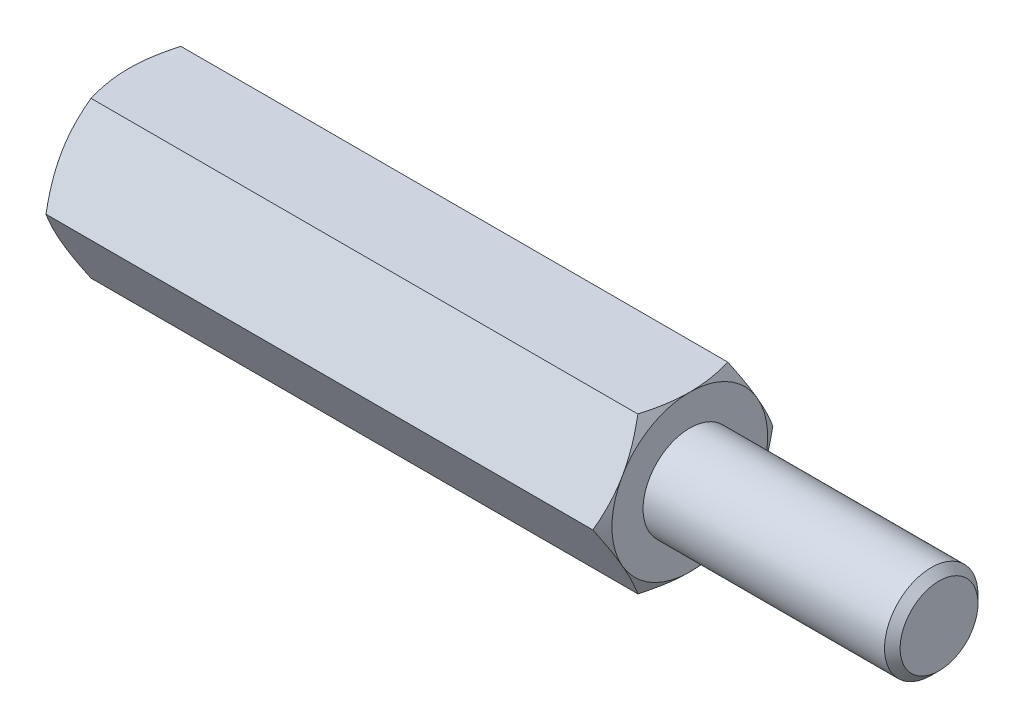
ISO-10303-21;
HEADER;
FILE_DESCRIPTION(('STEP AP214'),'2;1');
FILE_NAME('part.step','',(''),(''),'','','');
FILE_SCHEMA(('AUTOMOTIVE_DESIGN { 1 0 10303 214 1 1 1 1 }'));
ENDSEC;
DATA;
#1=APPLICATION_CONTEXT('core data for automotive mechanical design processes');
#2=APPLICATION_PROTOCOL_DEFINITION('international standard','automotive_design',2000,#1);
#3=PRODUCT_CONTEXT('',#1,'mechanical');
#4=PRODUCT('Part','Part','',(#3));
#5=PRODUCT_RELATED_PRODUCT_CATEGORY('part','',(#4));
#6=PRODUCT_DEFINITION_FORMATION('','',#4);
#7=PRODUCT_DEFINITION_CONTEXT('part definition',#1,'design');
#8=PRODUCT_DEFINITION('design','',#6,#7);
#9=PRODUCT_DEFINITION_SHAPE('','',#8);
#10=(LENGTH_UNIT() NAMED_UNIT(*) SI_UNIT(.MILLI.,.METRE.));
#11=(NAMED_UNIT(*) PLANE_ANGLE_UNIT() SI_UNIT($,.RADIAN.));
#12=(NAMED_UNIT(*) SI_UNIT($,.STERADIAN.) SOLID_ANGLE_UNIT());
#13=UNCERTAINTY_MEASURE_WITH_UNIT(LENGTH_MEASURE(1.E-05),#10,'distance_accuracy_value','');
#14=(GEOMETRIC_REPRESENTATION_CONTEXT(3) GLOBAL_UNCERTAINTY_ASSIGNED_CONTEXT((#13)) GLOBAL_UNIT_ASSIGNED_CONTEXT((#10,
#11,#12)) REPRESENTATION_CONTEXT('',''));
#15=CARTESIAN_POINT('',(0.,0.,0.));
#16=DIRECTION('',(0.,0.,1.));
#17=DIRECTION('',(1.,0.,0.));
#18=AXIS2_PLACEMENT_3D('',#15,#16,#17);
#19=CARTESIAN_POINT('',(9.,2.5,-1.44337567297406));
#20=DIRECTION('',(1.,0.,0.));
#21=DIRECTION('',(0.,0.,-1.));
#22=AXIS2_PLACEMENT_3D('',#19,#20,#21);
#23=PLANE('',#22);
#24=CARTESIAN_POINT('',(9.,0.,0.));
#25=DIRECTION('',(1.,0.,0.));
#26=DIRECTION('',(0.,0.,-1.));
#27=AXIS2_PLACEMENT_3D('',#24,#25,#26);
#28=CIRCLE('',#27,2.5);
#29=CARTESIAN_POINT('',(9.,-1.25,-2.1650635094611));
#30=VERTEX_POINT('',#29);
#31=CARTESIAN_POINT('',(9.,1.25,-2.1650635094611));
#32=VERTEX_POINT('',#31);
#33=EDGE_CURVE('E288',#30,#32,#28,.T.);
#34=ORIENTED_EDGE('',*,*,#33,.T.);
#35=CARTESIAN_POINT('',(9.,2.5,0.));
#36=VERTEX_POINT('',#35);
#37=EDGE_CURVE('E53',#32,#36,#28,.T.);
#38=ORIENTED_EDGE('',*,*,#37,.T.);
#39=CARTESIAN_POINT('',(9.,1.25,2.1650635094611));
#40=VERTEX_POINT('',#39);
#41=EDGE_CURVE('E296',#36,#40,#28,.T.);
#42=ORIENTED_EDGE('',*,*,#41,.T.);
#43=CARTESIAN_POINT('',(9.,-1.25,2.1650635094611));
#44=VERTEX_POINT('',#43);
#45=EDGE_CURVE('E301',#40,#44,#28,.T.);
#46=ORIENTED_EDGE('',*,*,#45,.T.);
#47=CARTESIAN_POINT('',(9.,0.,0.));
#48=DIRECTION('',(-1.,0.,0.));
#49=DIRECTION('',(0.,-1.,0.));
#50=AXIS2_PLACEMENT_3D('',#47,#48,#49);
#51=CIRCLE('',#50,2.5);
#52=CARTESIAN_POINT('',(9.,-2.5,0.));
#53=VERTEX_POINT('',#52);
#54=EDGE_CURVE('E193',#53,#44,#51,.T.);
#55=ORIENTED_EDGE('',*,*,#54,.F.);
#56=EDGE_CURVE('E61',#53,#30,#28,.T.);
#57=ORIENTED_EDGE('',*,*,#56,.T.);
#58=EDGE_LOOP('',(#34,#38,#42,#46,#55,#57));
#59=FACE_BOUND('',#58,.T.);
#60=CARTESIAN_POINT('',(9.,0.,0.));
#61=DIRECTION('',(1.,0.,0.));
#62=DIRECTION('',(0.,0.,-1.));
#63=AXIS2_PLACEMENT_3D('',#60,#61,#62);
#64=CIRCLE('',#63,1.5);
#65=CARTESIAN_POINT('',(9.,0.,-1.5));
#66=VERTEX_POINT('',#65);
#67=EDGE_CURVE('E329',#66,#66,#64,.T.);
#68=ORIENTED_EDGE('',*,*,#67,.F.);
#69=EDGE_LOOP('',(#68));
#70=FACE_BOUND('',#69,.T.);
#71=ADVANCED_FACE('F37',(#59,#70),#23,.T.);
#72=CARTESIAN_POINT('',(9.,0.,-2.88675134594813));
#73=DIRECTION('',(0.,-0.5,0.866025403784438));
#74=DIRECTION('',(0.,-0.866025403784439,-0.5));
#75=AXIS2_PLACEMENT_3D('',#72,#73,#74);
#76=PLANE('',#75);
#77=CARTESIAN_POINT('',(8.7766423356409,-0.000199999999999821,-2.88686681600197));
#78=CARTESIAN_POINT('',(8.81327837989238,0.109663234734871,-2.82343724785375));
#79=CARTESIAN_POINT('',(8.84659778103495,0.220474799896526,-2.75946016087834));
#80=CARTESIAN_POINT('',(8.90475771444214,0.44401683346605,-2.63039810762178));
#81=CARTESIAN_POINT('',(8.92957767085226,0.556751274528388,-2.5653108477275));
#82=CARTESIAN_POINT('',(8.96821434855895,0.780822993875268,-2.43594298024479));
#83=CARTESIAN_POINT('',(8.98228820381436,0.892125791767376,-2.37168227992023));
#84=CARTESIAN_POINT('',(8.99909084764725,1.11525522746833,-2.24285844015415));
#85=CARTESIAN_POINT('',(9.00183354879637,1.22708105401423,-2.17829576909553));
#86=CARTESIAN_POINT('',(8.99613423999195,1.43604197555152,-2.05765212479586));
#87=CARTESIAN_POINT('',(8.98909160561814,1.53320831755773,-2.0015531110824));
#88=CARTESIAN_POINT('',(8.96676858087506,1.726907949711,-1.88972057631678));
#89=CARTESIAN_POINT('',(8.95148056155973,1.82344056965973,-1.8339874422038));
#90=CARTESIAN_POINT('',(8.91326090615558,2.01753972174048,-1.7219242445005));
#91=CARTESIAN_POINT('',(8.89016722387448,2.11508168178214,-1.66560836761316));
#92=CARTESIAN_POINT('',(8.83775334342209,2.30871060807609,-1.55381665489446));
#93=CARTESIAN_POINT('',(8.80844546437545,2.40480005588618,-1.49833938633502));
#94=CARTESIAN_POINT('',(8.7766423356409,2.5002,-1.44326020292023));
#95=B_SPLINE_CURVE_WITH_KNOTS('',3,(#77,#78,#79,#80,#81,#82,#83,#84,#85,#86,#87,#88,#89,#90,#91,
#92,#93,#94),.UNSPECIFIED.,.F.,.F.,(4,2,2,2,2,2,2,2,4),(0.,0.396285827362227,0.79352433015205,
1.18093086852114,1.56786160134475,1.90479741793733,2.24204551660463,2.58677531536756,
2.93082800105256),.UNSPECIFIED.);
#96=CARTESIAN_POINT('',(8.7767090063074,0.,-2.88675134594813));
#97=VERTEX_POINT('',#96);
#98=EDGE_CURVE('E336',#97,#32,#95,.T.);
#99=ORIENTED_EDGE('',*,*,#98,.F.);
#100=DIRECTION('',(-1.,0.,0.));
#101=VECTOR('',#100,1.);
#102=CARTESIAN_POINT('',(9.,0.,-2.88675134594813));
#103=LINE('',#102,#101);
#104=CARTESIAN_POINT('',(-8.7767090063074,0.,-2.88675134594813));
#105=VERTEX_POINT('',#104);
#106=EDGE_CURVE('E264',#97,#105,#103,.T.);
#107=ORIENTED_EDGE('',*,*,#106,.T.);
#108=CARTESIAN_POINT('',(-8.7766423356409,2.5002,-1.44326020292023));
#109=CARTESIAN_POINT('',(-8.81327837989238,2.39033676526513,-1.50668977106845));
#110=CARTESIAN_POINT('',(-8.84659778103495,2.27952520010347,-1.57066685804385));
#111=CARTESIAN_POINT('',(-8.90475771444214,2.05598316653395,-1.69972891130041));
#112=CARTESIAN_POINT('',(-8.92957767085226,1.94324872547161,-1.7648161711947));
#113=CARTESIAN_POINT('',(-8.96821434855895,1.71917700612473,-1.8941840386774));
#114=CARTESIAN_POINT('',(-8.98228820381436,1.60787420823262,-1.95844473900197));
#115=CARTESIAN_POINT('',(-8.99909084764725,1.38474477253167,-2.08726857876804));
#116=CARTESIAN_POINT('',(-9.00183354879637,1.27291894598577,-2.15183124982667));
#117=CARTESIAN_POINT('',(-8.99613423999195,1.06395802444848,-2.27247489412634));
#118=CARTESIAN_POINT('',(-8.98909160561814,0.96679168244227,-2.32857390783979));
#119=CARTESIAN_POINT('',(-8.96676858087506,0.773092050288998,-2.44040644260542));
#120=CARTESIAN_POINT('',(-8.95148056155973,0.676559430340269,-2.49613957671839));
#121=CARTESIAN_POINT('',(-8.91326090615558,0.482460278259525,-2.60820277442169));
#122=CARTESIAN_POINT('',(-8.89016722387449,0.38491831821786,-2.66451865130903));
#123=CARTESIAN_POINT('',(-8.83775334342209,0.191289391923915,-2.77631036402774));
#124=CARTESIAN_POINT('',(-8.80844546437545,0.0951999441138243,-2.83178763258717));
#125=CARTESIAN_POINT('',(-8.7766423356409,-0.000199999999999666,-2.88686681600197));
#126=B_SPLINE_CURVE_WITH_KNOTS('',3,(#108,#109,#110,#111,#112,#113,#114,#115,#116,#117,#118,
#119,#120,#121,#122,#123,#124,#125),.UNSPECIFIED.,.F.,.F.,(4,2,2,2,2,2,2,2,4),(0.,
0.396285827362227,0.79352433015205,1.18093086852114,1.56786160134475,1.90479741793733,
2.24204551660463,2.58677531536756,2.93082800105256),.UNSPECIFIED.);
#127=CARTESIAN_POINT('',(-9.,1.25,-2.1650635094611));
#128=VERTEX_POINT('',#127);
#129=EDGE_CURVE('E313',#128,#105,#126,.T.);
#130=ORIENTED_EDGE('',*,*,#129,.F.);
#131=CARTESIAN_POINT('',(-8.7767090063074,2.5,-1.44337567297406));
#132=VERTEX_POINT('',#131);
#133=EDGE_CURVE('E317',#132,#128,#126,.T.);
#134=ORIENTED_EDGE('',*,*,#133,.F.);
#135=DIRECTION('',(-1.,0.,0.));
#136=VECTOR('',#135,1.);
#137=CARTESIAN_POINT('',(9.,2.5,-1.44337567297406));
#138=LINE('',#137,#136);
#139=CARTESIAN_POINT('',(8.77670900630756,2.5,-1.44337567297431));
#140=VERTEX_POINT('',#139);
#141=EDGE_CURVE('E279',#140,#132,#138,.T.);
#142=ORIENTED_EDGE('',*,*,#141,.F.);
#143=EDGE_CURVE('E229',#32,#140,#95,.T.);
#144=ORIENTED_EDGE('',*,*,#143,.F.);
#145=EDGE_LOOP('',(#99,#107,#130,#134,#142,#144));
#146=FACE_BOUND('',#145,.T.);
#147=ADVANCED_FACE('F148',(#146),#76,.F.);
#148=CARTESIAN_POINT('',(9.,2.5,-1.44337567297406));
#149=DIRECTION('',(0.,-1.,0.));
#150=DIRECTION('',(0.,0.,-1.));
#151=AXIS2_PLACEMENT_3D('',#148,#149,#150);
#152=PLANE('',#151);
#153=CARTESIAN_POINT('',(7.76803388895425,2.5,-3.90158441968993));
#154=CARTESIAN_POINT('',(7.82120772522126,2.5,-3.79217004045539));
#155=CARTESIAN_POINT('',(7.87387869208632,2.5,-3.68250707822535));
#156=CARTESIAN_POINT('',(7.97793249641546,2.5,-3.46255185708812));
#157=CARTESIAN_POINT('',(8.02931513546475,2.5,-3.35225950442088));
#158=CARTESIAN_POINT('',(8.13076309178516,2.5,-3.13035696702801));
#159=CARTESIAN_POINT('',(8.18081992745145,2.5,-3.0187428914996));
#160=CARTESIAN_POINT('',(8.27891712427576,2.5,-2.79463535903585));
#161=CARTESIAN_POINT('',(8.32695757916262,2.5,-2.68214194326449));
#162=CARTESIAN_POINT('',(8.42201845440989,2.5,-2.45240385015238));
#163=CARTESIAN_POINT('',(8.46895431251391,2.5,-2.33512399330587));
#164=CARTESIAN_POINT('',(8.55933269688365,2.5,-2.09920133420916));
#165=CARTESIAN_POINT('',(8.60277483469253,2.5,-1.98055838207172));
#166=CARTESIAN_POINT('',(8.68504351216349,2.5,-1.74193489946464));
#167=CARTESIAN_POINT('',(8.72387917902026,2.5,-1.6219575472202));
#168=CARTESIAN_POINT('',(8.79570507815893,2.5,-1.38028205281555));
#169=CARTESIAN_POINT('',(8.82869712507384,2.5,-1.25858445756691));
#170=CARTESIAN_POINT('',(8.88709594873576,2.5,-1.01406369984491));
#171=CARTESIAN_POINT('',(8.91254379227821,2.5,-0.89125052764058));
#172=CARTESIAN_POINT('',(8.95442751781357,2.5,-0.644071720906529));
#173=CARTESIAN_POINT('',(8.97086432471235,2.5,-0.519706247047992));
#174=CARTESIAN_POINT('',(8.9932006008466,2.5,-0.271679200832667));
#175=CARTESIAN_POINT('',(8.99923751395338,2.5,-0.148030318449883));
#176=CARTESIAN_POINT('',(9.00062561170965,2.5,0.0993395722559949));
#177=CARTESIAN_POINT('',(8.99597656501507,2.5,0.223060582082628));
#178=CARTESIAN_POINT('',(8.97940443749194,2.5,0.432351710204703));
#179=CARTESIAN_POINT('',(8.97010665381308,2.5,0.518143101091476));
#180=CARTESIAN_POINT('',(8.94693847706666,2.5,0.689112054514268));
#181=CARTESIAN_POINT('',(8.93306748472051,2.5,0.77428953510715));
#182=CARTESIAN_POINT('',(8.88532020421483,2.5,1.02876599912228));
#183=CARTESIAN_POINT('',(8.84531764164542,2.5,1.19691958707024));
#184=CARTESIAN_POINT('',(8.75226567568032,2.5,1.53362893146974));
#185=CARTESIAN_POINT('',(8.69893620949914,2.5,1.70210423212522));
#186=CARTESIAN_POINT('',(8.61237169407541,2.5,1.95247339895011));
#187=CARTESIAN_POINT('',(8.58242477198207,2.5,2.03553184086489));
#188=CARTESIAN_POINT('',(8.52068409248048,2.5,2.20095860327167));
#189=CARTESIAN_POINT('',(8.48889037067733,2.5,2.2833269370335));
#190=CARTESIAN_POINT('',(8.40401426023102,2.5,2.49723312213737));
#191=CARTESIAN_POINT('',(8.34971733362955,2.5,2.6282879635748));
#192=CARTESIAN_POINT('',(8.23812739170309,2.5,2.88912034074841));
#193=CARTESIAN_POINT('',(8.1808341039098,2.5,3.01889775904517));
#194=CARTESIAN_POINT('',(8.06393487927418,2.5,3.27745045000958));
#195=CARTESIAN_POINT('',(8.00432825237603,2.5,3.40622540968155));
#196=CARTESIAN_POINT('',(7.88332345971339,2.5,3.66293235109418));
#197=CARTESIAN_POINT('',(7.82192524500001,2.5,3.79086430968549));
#198=CARTESIAN_POINT('',(7.6354580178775,2.5,4.17399495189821));
#199=CARTESIAN_POINT('',(7.50828249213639,2.5,4.42816724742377));
#200=CARTESIAN_POINT('',(7.25034557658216,2.5,4.93461464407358));
#201=CARTESIAN_POINT('',(7.11958483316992,2.5,5.18689007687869));
#202=CARTESIAN_POINT('',(6.86871001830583,2.5,5.66512451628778));
#203=CARTESIAN_POINT('',(6.74882986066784,2.5,5.89120644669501));
#204=CARTESIAN_POINT('',(6.50759021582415,2.5,6.34259369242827));
#205=CARTESIAN_POINT('',(6.38623065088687,2.5,6.56789896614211));
#206=CARTESIAN_POINT('',(6.14278038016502,2.5,7.01722044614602));
#207=CARTESIAN_POINT('',(6.02069305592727,2.5,7.24123848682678));
#208=CARTESIAN_POINT('',(5.77566624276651,2.5,7.68878772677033));
#209=CARTESIAN_POINT('',(5.65272681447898,2.5,7.91231895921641));
#210=CARTESIAN_POINT('',(5.52947566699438,2.5,8.13567697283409));
#211=B_SPLINE_CURVE_WITH_KNOTS('',3,(#153,#154,#155,#156,#157,#158,#159,#160,#161,#162,#163,
#164,#165,#166,#167,#168,#169,#170,#171,#172,#173,#174,#175,#176,#177,#178,#179,#180,#181,#182,
#183,#184,#185,#186,#187,#188,#189,#190,#191,#192,#193,#194,#195,#196,#197,#198,#199,#200,#201,
#202,#203,#204,#205,#206,#207,#208,#209,#210),.UNSPECIFIED.,.F.,.F.,(4,2,2,2,2,2,2,2,2,2,2,2,2,
2,2,2,2,2,2,2,2,2,2,2,2,2,2,2,4),(0.,0.364957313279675,0.729970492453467,1.09692930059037,
1.46387103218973,1.84279746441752,2.22176597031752,2.59997058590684,2.97805755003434,
3.35404692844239,3.72999770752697,4.10094071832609,4.47189175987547,4.73064905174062,
4.98944026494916,5.5072907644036,6.03710483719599,6.30196454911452,6.56681915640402,
6.99233818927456,7.41789598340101,7.84358170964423,8.26927907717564,9.12186602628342,
9.9743002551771,10.7419897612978,11.5097197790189,12.2750964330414,13.0404191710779),.UNSPECIFIED.);
#212=EDGE_CURVE('E227',#140,#36,#211,.T.);
#213=ORIENTED_EDGE('',*,*,#212,.F.);
#214=ORIENTED_EDGE('',*,*,#141,.T.);
#215=CARTESIAN_POINT('',(-7.76803388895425,2.5,-3.90158441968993));
#216=CARTESIAN_POINT('',(-7.82120772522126,2.5,-3.79217004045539));
#217=CARTESIAN_POINT('',(-7.87387869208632,2.5,-3.68250707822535));
#218=CARTESIAN_POINT('',(-7.97793249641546,2.5,-3.46255185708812));
#219=CARTESIAN_POINT('',(-8.02931513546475,2.5,-3.35225950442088));
#220=CARTESIAN_POINT('',(-8.13076309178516,2.5,-3.13035696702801));
#221=CARTESIAN_POINT('',(-8.18081992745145,2.5,-3.0187428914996));
#222=CARTESIAN_POINT('',(-8.27891712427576,2.5,-2.79463535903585));
#223=CARTESIAN_POINT('',(-8.32695757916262,2.5,-2.68214194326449));
#224=CARTESIAN_POINT('',(-8.42201845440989,2.5,-2.45240385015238));
#225=CARTESIAN_POINT('',(-8.46895431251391,2.5,-2.33512399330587));
#226=CARTESIAN_POINT('',(-8.55933269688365,2.5,-2.09920133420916));
#227=CARTESIAN_POINT('',(-8.60277483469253,2.5,-1.98055838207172));
#228=CARTESIAN_POINT('',(-8.68504351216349,2.5,-1.74193489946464));
#229=CARTESIAN_POINT('',(-8.72387917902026,2.5,-1.6219575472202));
#230=CARTESIAN_POINT('',(-8.79570507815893,2.5,-1.38028205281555));
#231=CARTESIAN_POINT('',(-8.82869712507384,2.5,-1.25858445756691));
#232=CARTESIAN_POINT('',(-8.88709594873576,2.5,-1.01406369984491));
#233=CARTESIAN_POINT('',(-8.91254379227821,2.5,-0.89125052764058));
#234=CARTESIAN_POINT('',(-8.95442751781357,2.5,-0.644071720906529));
#235=CARTESIAN_POINT('',(-8.97086432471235,2.5,-0.519706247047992));
#236=CARTESIAN_POINT('',(-8.9932006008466,2.5,-0.271679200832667));
#237=CARTESIAN_POINT('',(-8.99923751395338,2.5,-0.148030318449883));
#238=CARTESIAN_POINT('',(-9.00062561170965,2.5,0.0993395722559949));
#239=CARTESIAN_POINT('',(-8.99597656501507,2.5,0.223060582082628));
#240=CARTESIAN_POINT('',(-8.97940443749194,2.5,0.432351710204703));
#241=CARTESIAN_POINT('',(-8.97010665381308,2.5,0.518143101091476));
#242=CARTESIAN_POINT('',(-8.94693847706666,2.5,0.689112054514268));
#243=CARTESIAN_POINT('',(-8.93306748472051,2.5,0.77428953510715));
#244=CARTESIAN_POINT('',(-8.88532020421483,2.5,1.02876599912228));
#245=CARTESIAN_POINT('',(-8.84531764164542,2.5,1.19691958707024));
#246=CARTESIAN_POINT('',(-8.75226567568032,2.5,1.53362893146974));
#247=CARTESIAN_POINT('',(-8.69893620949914,2.5,1.70210423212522));
#248=CARTESIAN_POINT('',(-8.61237169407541,2.5,1.95247339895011));
#249=CARTESIAN_POINT('',(-8.58242477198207,2.5,2.03553184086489));
#250=CARTESIAN_POINT('',(-8.52068409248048,2.5,2.20095860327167));
#251=CARTESIAN_POINT('',(-8.48889037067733,2.5,2.2833269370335));
#252=CARTESIAN_POINT('',(-8.40401426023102,2.5,2.49723312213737));
#253=CARTESIAN_POINT('',(-8.34971733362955,2.5,2.6282879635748));
#254=CARTESIAN_POINT('',(-8.23812739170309,2.5,2.88912034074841));
#255=CARTESIAN_POINT('',(-8.1808341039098,2.5,3.01889775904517));
#256=CARTESIAN_POINT('',(-8.06393487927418,2.5,3.27745045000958));
#257=CARTESIAN_POINT('',(-8.00432825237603,2.5,3.40622540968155));
#258=CARTESIAN_POINT('',(-7.88332345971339,2.5,3.66293235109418));
#259=CARTESIAN_POINT('',(-7.82192524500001,2.5,3.79086430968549));
#260=CARTESIAN_POINT('',(-7.6354580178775,2.5,4.17399495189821));
#261=CARTESIAN_POINT('',(-7.50828249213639,2.5,4.42816724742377));
#262=CARTESIAN_POINT('',(-7.25034557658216,2.5,4.93461464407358));
#263=CARTESIAN_POINT('',(-7.11958483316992,2.5,5.18689007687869));
#264=CARTESIAN_POINT('',(-6.86871001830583,2.5,5.66512451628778));
#265=CARTESIAN_POINT('',(-6.74882986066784,2.5,5.89120644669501));
#266=CARTESIAN_POINT('',(-6.50759021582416,2.5,6.34259369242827));
#267=CARTESIAN_POINT('',(-6.38623065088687,2.5,6.56789896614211));
#268=CARTESIAN_POINT('',(-6.14278038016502,2.5,7.01722044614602));
#269=CARTESIAN_POINT('',(-6.02069305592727,2.5,7.24123848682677));
#270=CARTESIAN_POINT('',(-5.77566624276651,2.5,7.68878772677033));
#271=CARTESIAN_POINT('',(-5.65272681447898,2.5,7.9123189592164));
#272=CARTESIAN_POINT('',(-5.52947566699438,2.5,8.13567697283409));
#273=B_SPLINE_CURVE_WITH_KNOTS('',3,(#215,#216,#217,#218,#219,#220,#221,#222,#223,#224,#225,
#226,#227,#228,#229,#230,#231,#232,#233,#234,#235,#236,#237,#238,#239,#240,#241,#242,#243,#244,
#245,#246,#247,#248,#249,#250,#251,#252,#253,#254,#255,#256,#257,#258,#259,#260,#261,#262,#263,
#264,#265,#266,#267,#268,#269,#270,#271,#272),.UNSPECIFIED.,.F.,.F.,(4,2,2,2,2,2,2,2,2,2,2,2,2,
2,2,2,2,2,2,2,2,2,2,2,2,2,2,2,4),(0.,0.364957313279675,0.729970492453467,1.09692930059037,
1.46387103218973,1.84279746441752,2.22176597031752,2.59997058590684,2.97805755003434,
3.35404692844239,3.72999770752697,4.10094071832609,4.47189175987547,4.73064905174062,
4.98944026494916,5.5072907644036,6.03710483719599,6.30196454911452,6.56681915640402,
6.99233818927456,7.41789598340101,7.84358170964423,8.26927907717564,9.12186602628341,
9.97430025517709,10.7419897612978,11.5097197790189,12.2750964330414,13.0404191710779),.UNSPECIFIED.);
#274=CARTESIAN_POINT('',(-9.,2.5,0.));
#275=VERTEX_POINT('',#274);
#276=EDGE_CURVE('E241',#275,#132,#273,.F.);
#277=ORIENTED_EDGE('',*,*,#276,.F.);
#278=CARTESIAN_POINT('',(-8.7767090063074,2.5,1.44337567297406));
#279=VERTEX_POINT('',#278);
#280=EDGE_CURVE('E249',#279,#275,#273,.F.);
#281=ORIENTED_EDGE('',*,*,#280,.F.);
#282=DIRECTION('',(-1.,0.,0.));
#283=VECTOR('',#282,1.);
#284=CARTESIAN_POINT('',(9.,2.5,1.44337567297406));
#285=LINE('',#284,#283);
#286=CARTESIAN_POINT('',(8.7767090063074,2.5,1.44337567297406));
#287=VERTEX_POINT('',#286);
#288=EDGE_CURVE('E276',#287,#279,#285,.T.);
#289=ORIENTED_EDGE('',*,*,#288,.F.);
#290=EDGE_CURVE('E221',#36,#287,#211,.T.);
#291=ORIENTED_EDGE('',*,*,#290,.F.);
#292=EDGE_LOOP('',(#213,#214,#277,#281,#289,#291));
#293=FACE_BOUND('',#292,.T.);
#294=ADVANCED_FACE('F153',(#293),#152,.F.);
#295=CARTESIAN_POINT('',(9.,2.5,1.44337567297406));
#296=DIRECTION('',(0.,-0.5,-0.866025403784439));
#297=DIRECTION('',(0.,0.866025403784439,-0.5));
#298=AXIS2_PLACEMENT_3D('',#295,#296,#297);
#299=PLANE('',#298);
#300=CARTESIAN_POINT('',(8.7766423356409,2.5002,1.44326020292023));
#301=CARTESIAN_POINT('',(8.81327837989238,2.39033676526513,1.50668977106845));
#302=CARTESIAN_POINT('',(8.84659778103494,2.27952520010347,1.57066685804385));
#303=CARTESIAN_POINT('',(8.90475771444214,2.05598316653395,1.69972891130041));
#304=CARTESIAN_POINT('',(8.92957767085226,1.94324872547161,1.7648161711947));
#305=CARTESIAN_POINT('',(8.96821434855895,1.71917700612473,1.8941840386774));
#306=CARTESIAN_POINT('',(8.98228820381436,1.60787420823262,1.95844473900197));
#307=CARTESIAN_POINT('',(8.99909084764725,1.38474477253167,2.08726857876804));
#308=CARTESIAN_POINT('',(9.00183354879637,1.27291894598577,2.15183124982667));
#309=CARTESIAN_POINT('',(8.99613423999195,1.06395802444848,2.27247489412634));
#310=CARTESIAN_POINT('',(8.98909160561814,0.96679168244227,2.32857390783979));
#311=CARTESIAN_POINT('',(8.96676858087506,0.773092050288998,2.44040644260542));
#312=CARTESIAN_POINT('',(8.95148056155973,0.676559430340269,2.49613957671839));
#313=CARTESIAN_POINT('',(8.91326090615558,0.482460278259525,2.60820277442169));
#314=CARTESIAN_POINT('',(8.89016722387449,0.384918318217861,2.66451865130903));
#315=CARTESIAN_POINT('',(8.83775334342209,0.191289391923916,2.77631036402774));
#316=CARTESIAN_POINT('',(8.80844546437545,0.0951999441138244,2.83178763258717));
#317=CARTESIAN_POINT('',(8.7766423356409,-0.00019999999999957,2.88686681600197));
#318=B_SPLINE_CURVE_WITH_KNOTS('',3,(#300,#301,#302,#303,#304,#305,#306,#307,#308,#309,#310,
#311,#312,#313,#314,#315,#316,#317),.UNSPECIFIED.,.F.,.F.,(4,2,2,2,2,2,2,2,4),(0.,
0.396285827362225,0.79352433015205,1.18093086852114,1.56786160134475,1.90479741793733,
2.24204551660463,2.58677531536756,2.93082800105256),.UNSPECIFIED.);
#319=EDGE_CURVE('E228',#287,#40,#318,.T.);
#320=ORIENTED_EDGE('',*,*,#319,.F.);
#321=ORIENTED_EDGE('',*,*,#288,.T.);
#322=CARTESIAN_POINT('',(-8.7766423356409,-0.000199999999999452,2.88686681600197));
#323=CARTESIAN_POINT('',(-8.81327837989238,0.109663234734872,2.82343724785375));
#324=CARTESIAN_POINT('',(-8.84659778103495,0.220474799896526,2.75946016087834));
#325=CARTESIAN_POINT('',(-8.90475771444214,0.44401683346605,2.63039810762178));
#326=CARTESIAN_POINT('',(-8.92957767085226,0.556751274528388,2.5653108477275));
#327=CARTESIAN_POINT('',(-8.96821434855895,0.780822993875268,2.43594298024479));
#328=CARTESIAN_POINT('',(-8.98228820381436,0.892125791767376,2.37168227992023));
#329=CARTESIAN_POINT('',(-8.99909084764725,1.11525522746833,2.24285844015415));
#330=CARTESIAN_POINT('',(-9.00183354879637,1.22708105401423,2.17829576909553));
#331=CARTESIAN_POINT('',(-8.99613423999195,1.43604197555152,2.05765212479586));
#332=CARTESIAN_POINT('',(-8.98909160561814,1.53320831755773,2.0015531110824));
#333=CARTESIAN_POINT('',(-8.96676858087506,1.726907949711,1.88972057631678));
#334=CARTESIAN_POINT('',(-8.95148056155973,1.82344056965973,1.8339874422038));
#335=CARTESIAN_POINT('',(-8.91326090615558,2.01753972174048,1.7219242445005));
#336=CARTESIAN_POINT('',(-8.89016722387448,2.11508168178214,1.66560836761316));
#337=CARTESIAN_POINT('',(-8.83775334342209,2.30871060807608,1.55381665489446));
#338=CARTESIAN_POINT('',(-8.80844546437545,2.40480005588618,1.49833938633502));
#339=CARTESIAN_POINT('',(-8.7766423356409,2.5002,1.44326020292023));
#340=B_SPLINE_CURVE_WITH_KNOTS('',3,(#322,#323,#324,#325,#326,#327,#328,#329,#330,#331,#332,
#333,#334,#335,#336,#337,#338,#339),.UNSPECIFIED.,.F.,.F.,(4,2,2,2,2,2,2,2,4),(0.,
0.396285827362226,0.793524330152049,1.18093086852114,1.56786160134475,1.90479741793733,
2.24204551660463,2.58677531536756,2.93082800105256),.UNSPECIFIED.);
#341=CARTESIAN_POINT('',(-9.,1.25,2.1650635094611));
#342=VERTEX_POINT('',#341);
#343=EDGE_CURVE('E255',#342,#279,#340,.T.);
#344=ORIENTED_EDGE('',*,*,#343,.F.);
#345=CARTESIAN_POINT('',(-8.7767090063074,0.,2.88675134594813));
#346=VERTEX_POINT('',#345);
#347=EDGE_CURVE('E262',#346,#342,#340,.T.);
#348=ORIENTED_EDGE('',*,*,#347,.F.);
#349=DIRECTION('',(-1.,0.,0.));
#350=VECTOR('',#349,1.);
#351=CARTESIAN_POINT('',(9.,0.,2.88675134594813));
#352=LINE('',#351,#350);
#353=CARTESIAN_POINT('',(8.7767090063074,0.,2.88675134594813));
#354=VERTEX_POINT('',#353);
#355=EDGE_CURVE('E273',#354,#346,#352,.T.);
#356=ORIENTED_EDGE('',*,*,#355,.F.);
#357=EDGE_CURVE('E215',#40,#354,#318,.T.);
#358=ORIENTED_EDGE('',*,*,#357,.F.);
#359=EDGE_LOOP('',(#320,#321,#344,#348,#356,#358));
#360=FACE_BOUND('',#359,.T.);
#361=ADVANCED_FACE('F235',(#360),#299,.F.);
#362=CARTESIAN_POINT('',(9.,0.,2.88675134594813));
#363=DIRECTION('',(0.,0.5,-0.866025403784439));
#364=DIRECTION('',(0.,0.866025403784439,0.5));
#365=AXIS2_PLACEMENT_3D('',#362,#363,#364);
#366=PLANE('',#365);
#367=CARTESIAN_POINT('',(8.7766423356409,0.000200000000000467,2.88686681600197));
#368=CARTESIAN_POINT('',(8.81327837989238,-0.109663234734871,2.82343724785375));
#369=CARTESIAN_POINT('',(8.84659778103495,-0.220474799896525,2.75946016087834));
#370=CARTESIAN_POINT('',(8.90475771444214,-0.444016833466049,2.63039810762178));
#371=CARTESIAN_POINT('',(8.92957767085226,-0.556751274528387,2.5653108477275));
#372=CARTESIAN_POINT('',(8.96821434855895,-0.780822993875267,2.43594298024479));
#373=CARTESIAN_POINT('',(8.98228820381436,-0.892125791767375,2.37168227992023));
#374=CARTESIAN_POINT('',(8.99909084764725,-1.11525522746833,2.24285844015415));
#375=CARTESIAN_POINT('',(9.00183354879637,-1.22708105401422,2.17829576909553));
#376=CARTESIAN_POINT('',(8.99613423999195,-1.43604197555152,2.05765212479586));
#377=CARTESIAN_POINT('',(8.98909160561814,-1.53320831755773,2.0015531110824));
#378=CARTESIAN_POINT('',(8.96676858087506,-1.726907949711,1.88972057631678));
#379=CARTESIAN_POINT('',(8.95148056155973,-1.82344056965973,1.8339874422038));
#380=CARTESIAN_POINT('',(8.91326090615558,-2.01753972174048,1.7219242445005));
#381=CARTESIAN_POINT('',(8.89016722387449,-2.11508168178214,1.66560836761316));
#382=CARTESIAN_POINT('',(8.83775334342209,-2.30871060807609,1.55381665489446));
#383=CARTESIAN_POINT('',(8.80844546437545,-2.40480005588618,1.49833938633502));
#384=CARTESIAN_POINT('',(8.7766423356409,-2.5002,1.44326020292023));
#385=B_SPLINE_CURVE_WITH_KNOTS('',3,(#367,#368,#369,#370,#371,#372,#373,#374,#375,#376,#377,
#378,#379,#380,#381,#382,#383,#384),.UNSPECIFIED.,.F.,.F.,(4,2,2,2,2,2,2,2,4),(0.,
0.396285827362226,0.793524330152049,1.18093086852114,1.56786160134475,1.90479741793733,
2.24204551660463,2.58677531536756,2.93082800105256),.UNSPECIFIED.);
#386=EDGE_CURVE('E343',#354,#44,#385,.T.);
#387=ORIENTED_EDGE('',*,*,#386,.F.);
#388=ORIENTED_EDGE('',*,*,#355,.T.);
#389=CARTESIAN_POINT('',(-8.7766423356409,-2.5002,1.44326020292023));
#390=CARTESIAN_POINT('',(-8.81327837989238,-2.39033676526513,1.50668977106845));
#391=CARTESIAN_POINT('',(-8.84659778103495,-2.27952520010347,1.57066685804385));
#392=CARTESIAN_POINT('',(-8.90475771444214,-2.05598316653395,1.69972891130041));
#393=CARTESIAN_POINT('',(-8.92957767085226,-1.94324872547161,1.7648161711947));
#394=CARTESIAN_POINT('',(-8.96821434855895,-1.71917700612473,1.8941840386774));
#395=CARTESIAN_POINT('',(-8.98228820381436,-1.60787420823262,1.95844473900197));
#396=CARTESIAN_POINT('',(-8.99909084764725,-1.38474477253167,2.08726857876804));
#397=CARTESIAN_POINT('',(-9.00183354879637,-1.27291894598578,2.15183124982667));
#398=CARTESIAN_POINT('',(-8.99613423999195,-1.06395802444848,2.27247489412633));
#399=CARTESIAN_POINT('',(-8.98909160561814,-0.966791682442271,2.32857390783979));
#400=CARTESIAN_POINT('',(-8.96676858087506,-0.773092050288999,2.44040644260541));
#401=CARTESIAN_POINT('',(-8.95148056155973,-0.676559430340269,2.49613957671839));
#402=CARTESIAN_POINT('',(-8.91326090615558,-0.482460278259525,2.60820277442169));
#403=CARTESIAN_POINT('',(-8.89016722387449,-0.38491831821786,2.66451865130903));
#404=CARTESIAN_POINT('',(-8.83775334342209,-0.191289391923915,2.77631036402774));
#405=CARTESIAN_POINT('',(-8.80844546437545,-0.0951999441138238,2.83178763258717));
#406=CARTESIAN_POINT('',(-8.7766423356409,0.000200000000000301,2.88686681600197));
#407=B_SPLINE_CURVE_WITH_KNOTS('',3,(#389,#390,#391,#392,#393,#394,#395,#396,#397,#398,#399,
#400,#401,#402,#403,#404,#405,#406),.UNSPECIFIED.,.F.,.F.,(4,2,2,2,2,2,2,2,4),(0.,
0.396285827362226,0.793524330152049,1.18093086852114,1.56786160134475,1.90479741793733,
2.24204551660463,2.58677531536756,2.93082800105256),.UNSPECIFIED.);
#408=CARTESIAN_POINT('',(-9.,-1.25,2.1650635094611));
#409=VERTEX_POINT('',#408);
#410=EDGE_CURVE('E263',#409,#346,#407,.T.);
#411=ORIENTED_EDGE('',*,*,#410,.F.);
#412=CARTESIAN_POINT('',(-8.7767090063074,-2.5,1.44337567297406));
#413=VERTEX_POINT('',#412);
#414=EDGE_CURVE('E250',#413,#409,#407,.T.);
#415=ORIENTED_EDGE('',*,*,#414,.F.);
#416=DIRECTION('',(-1.,0.,0.));
#417=VECTOR('',#416,1.);
#418=CARTESIAN_POINT('',(9.,-2.5,1.44337567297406));
#419=LINE('',#418,#417);
#420=CARTESIAN_POINT('',(8.7767090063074,-2.5,1.44337567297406));
#421=VERTEX_POINT('',#420);
#422=EDGE_CURVE('E270',#421,#413,#419,.T.);
#423=ORIENTED_EDGE('',*,*,#422,.F.);
#424=EDGE_CURVE('E210',#44,#421,#385,.T.);
#425=ORIENTED_EDGE('',*,*,#424,.F.);
#426=EDGE_LOOP('',(#387,#388,#411,#415,#423,#425));
#427=FACE_BOUND('',#426,.T.);
#428=ADVANCED_FACE('F423',(#427),#366,.F.);
#429=CARTESIAN_POINT('',(9.,-2.5,1.44337567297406));
#430=DIRECTION('',(0.,1.,0.));
#431=DIRECTION('',(0.,0.,1.));
#432=AXIS2_PLACEMENT_3D('',#429,#430,#431);
#433=PLANE('',#432);
#434=CARTESIAN_POINT('',(7.76803388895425,-2.5,-3.90158441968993));
#435=CARTESIAN_POINT('',(7.82120772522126,-2.5,-3.79217004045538));
#436=CARTESIAN_POINT('',(7.87387869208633,-2.5,-3.68250707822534));
#437=CARTESIAN_POINT('',(7.97793249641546,-2.5,-3.46255185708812));
#438=CARTESIAN_POINT('',(8.02931513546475,-2.5,-3.35225950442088));
#439=CARTESIAN_POINT('',(8.13076309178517,-2.5,-3.130356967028));
#440=CARTESIAN_POINT('',(8.18081992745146,-2.5,-3.01874289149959));
#441=CARTESIAN_POINT('',(8.27891712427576,-2.5,-2.79463535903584));
#442=CARTESIAN_POINT('',(8.32695757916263,-2.5,-2.68214194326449));
#443=CARTESIAN_POINT('',(8.42201845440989,-2.5,-2.45240385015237));
#444=CARTESIAN_POINT('',(8.46895431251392,-2.5,-2.33512399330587));
#445=CARTESIAN_POINT('',(8.55933269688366,-2.5,-2.09920133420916));
#446=CARTESIAN_POINT('',(8.60277483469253,-2.5,-1.98055838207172));
#447=CARTESIAN_POINT('',(8.68504351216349,-2.5,-1.74193489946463));
#448=CARTESIAN_POINT('',(8.72387917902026,-2.5,-1.6219575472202));
#449=CARTESIAN_POINT('',(8.79570507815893,-2.5,-1.38028205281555));
#450=CARTESIAN_POINT('',(8.82869712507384,-2.5,-1.25858445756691));
#451=CARTESIAN_POINT('',(8.88709594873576,-2.5,-1.01406369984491));
#452=CARTESIAN_POINT('',(8.91254379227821,-2.5,-0.891250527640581));
#453=CARTESIAN_POINT('',(8.95442751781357,-2.5,-0.644071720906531));
#454=CARTESIAN_POINT('',(8.97086432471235,-2.5,-0.519706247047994));
#455=CARTESIAN_POINT('',(8.9932006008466,-2.5,-0.27167920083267));
#456=CARTESIAN_POINT('',(8.99923751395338,-2.5,-0.148030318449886));
#457=CARTESIAN_POINT('',(9.00062561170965,-2.5,0.0993395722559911));
#458=CARTESIAN_POINT('',(8.99597656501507,-2.5,0.223060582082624));
#459=CARTESIAN_POINT('',(8.97940443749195,-2.5,0.432351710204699));
#460=CARTESIAN_POINT('',(8.97010665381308,-2.5,0.518143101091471));
#461=CARTESIAN_POINT('',(8.94693847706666,-2.5,0.689112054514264));
#462=CARTESIAN_POINT('',(8.93306748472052,-2.5,0.774289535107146));
#463=CARTESIAN_POINT('',(8.88532020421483,-2.5,1.02876599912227));
#464=CARTESIAN_POINT('',(8.84531764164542,-2.5,1.19691958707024));
#465=CARTESIAN_POINT('',(8.75226567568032,-2.5,1.53362893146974));
#466=CARTESIAN_POINT('',(8.69893620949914,-2.5,1.70210423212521));
#467=CARTESIAN_POINT('',(8.61237169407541,-2.5,1.95247339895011));
#468=CARTESIAN_POINT('',(8.58242477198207,-2.5,2.03553184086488));
#469=CARTESIAN_POINT('',(8.52068409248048,-2.5,2.20095860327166));
#470=CARTESIAN_POINT('',(8.48889037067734,-2.5,2.28332693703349));
#471=CARTESIAN_POINT('',(8.40401426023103,-2.5,2.49723312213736));
#472=CARTESIAN_POINT('',(8.34971733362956,-2.5,2.6282879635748));
#473=CARTESIAN_POINT('',(8.2381273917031,-2.5,2.8891203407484));
#474=CARTESIAN_POINT('',(8.1808341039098,-2.5,3.01889775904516));
#475=CARTESIAN_POINT('',(8.06393487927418,-2.5,3.27745045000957));
#476=CARTESIAN_POINT('',(8.00432825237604,-2.5,3.40622540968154));
#477=CARTESIAN_POINT('',(7.8833234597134,-2.5,3.66293235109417));
#478=CARTESIAN_POINT('',(7.82192524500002,-2.5,3.79086430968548));
#479=CARTESIAN_POINT('',(7.6354580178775,-2.5,4.1739949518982));
#480=CARTESIAN_POINT('',(7.50828249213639,-2.5,4.42816724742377));
#481=CARTESIAN_POINT('',(7.25034557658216,-2.5,4.93461464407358));
#482=CARTESIAN_POINT('',(7.11958483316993,-2.5,5.18689007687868));
#483=CARTESIAN_POINT('',(6.86871001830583,-2.5,5.66512451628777));
#484=CARTESIAN_POINT('',(6.74882986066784,-2.5,5.891206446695));
#485=CARTESIAN_POINT('',(6.50759021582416,-2.5,6.34259369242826));
#486=CARTESIAN_POINT('',(6.38623065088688,-2.5,6.5678989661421));
#487=CARTESIAN_POINT('',(6.14278038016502,-2.5,7.01722044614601));
#488=CARTESIAN_POINT('',(6.02069305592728,-2.5,7.24123848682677));
#489=CARTESIAN_POINT('',(5.77566624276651,-2.5,7.68878772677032));
#490=CARTESIAN_POINT('',(5.65272681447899,-2.5,7.9123189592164));
#491=CARTESIAN_POINT('',(5.52947566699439,-2.5,8.13567697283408));
#492=B_SPLINE_CURVE_WITH_KNOTS('',3,(#434,#435,#436,#437,#438,#439,#440,#441,#442,#443,#444,
#445,#446,#447,#448,#449,#450,#451,#452,#453,#454,#455,#456,#457,#458,#459,#460,#461,#462,#463,
#464,#465,#466,#467,#468,#469,#470,#471,#472,#473,#474,#475,#476,#477,#478,#479,#480,#481,#482,
#483,#484,#485,#486,#487,#488,#489,#490,#491),.UNSPECIFIED.,.F.,.F.,(4,2,2,2,2,2,2,2,2,2,2,2,2,
2,2,2,2,2,2,2,2,2,2,2,2,2,2,2,4),(0.,0.364957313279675,0.729970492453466,1.09692930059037,
1.46387103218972,1.84279746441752,2.22176597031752,2.59997058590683,2.97805755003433,
3.35404692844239,3.72999770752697,4.10094071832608,4.47189175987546,4.73064905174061,
4.98944026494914,5.50729076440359,6.03710483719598,6.30196454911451,6.56681915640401,
6.99233818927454,7.417895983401,7.84358170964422,8.26927907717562,9.1218660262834,
9.97430025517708,10.7419897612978,11.5097197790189,12.2750964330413,13.0404191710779),.UNSPECIFIED.);
#493=EDGE_CURVE('E344',#421,#53,#492,.F.);
#494=ORIENTED_EDGE('',*,*,#493,.F.);
#495=ORIENTED_EDGE('',*,*,#422,.T.);
#496=CARTESIAN_POINT('',(-7.76803388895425,-2.5,-3.90158441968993));
#497=CARTESIAN_POINT('',(-7.82120772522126,-2.5,-3.79217004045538));
#498=CARTESIAN_POINT('',(-7.87387869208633,-2.5,-3.68250707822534));
#499=CARTESIAN_POINT('',(-7.97793249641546,-2.5,-3.46255185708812));
#500=CARTESIAN_POINT('',(-8.02931513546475,-2.5,-3.35225950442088));
#501=CARTESIAN_POINT('',(-8.13076309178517,-2.5,-3.130356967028));
#502=CARTESIAN_POINT('',(-8.18081992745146,-2.5,-3.01874289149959));
#503=CARTESIAN_POINT('',(-8.27891712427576,-2.5,-2.79463535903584));
#504=CARTESIAN_POINT('',(-8.32695757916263,-2.5,-2.68214194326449));
#505=CARTESIAN_POINT('',(-8.42201845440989,-2.5,-2.45240385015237));
#506=CARTESIAN_POINT('',(-8.46895431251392,-2.5,-2.33512399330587));
#507=CARTESIAN_POINT('',(-8.55933269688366,-2.5,-2.09920133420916));
#508=CARTESIAN_POINT('',(-8.60277483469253,-2.5,-1.98055838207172));
#509=CARTESIAN_POINT('',(-8.68504351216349,-2.5,-1.74193489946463));
#510=CARTESIAN_POINT('',(-8.72387917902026,-2.5,-1.6219575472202));
#511=CARTESIAN_POINT('',(-8.79570507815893,-2.5,-1.38028205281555));
#512=CARTESIAN_POINT('',(-8.82869712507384,-2.5,-1.25858445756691));
#513=CARTESIAN_POINT('',(-8.88709594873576,-2.5,-1.01406369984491));
#514=CARTESIAN_POINT('',(-8.91254379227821,-2.5,-0.891250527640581));
#515=CARTESIAN_POINT('',(-8.95442751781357,-2.5,-0.644071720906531));
#516=CARTESIAN_POINT('',(-8.97086432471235,-2.5,-0.519706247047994));
#517=CARTESIAN_POINT('',(-8.9932006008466,-2.5,-0.27167920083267));
#518=CARTESIAN_POINT('',(-8.99923751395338,-2.5,-0.148030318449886));
#519=CARTESIAN_POINT('',(-9.00062561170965,-2.5,0.0993395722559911));
#520=CARTESIAN_POINT('',(-8.99597656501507,-2.5,0.223060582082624));
#521=CARTESIAN_POINT('',(-8.97940443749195,-2.5,0.432351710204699));
#522=CARTESIAN_POINT('',(-8.97010665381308,-2.5,0.518143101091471));
#523=CARTESIAN_POINT('',(-8.94693847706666,-2.5,0.689112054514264));
#524=CARTESIAN_POINT('',(-8.93306748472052,-2.5,0.774289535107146));
#525=CARTESIAN_POINT('',(-8.88532020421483,-2.5,1.02876599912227));
#526=CARTESIAN_POINT('',(-8.84531764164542,-2.5,1.19691958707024));
#527=CARTESIAN_POINT('',(-8.75226567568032,-2.5,1.53362893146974));
#528=CARTESIAN_POINT('',(-8.69893620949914,-2.5,1.70210423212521));
#529=CARTESIAN_POINT('',(-8.61237169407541,-2.5,1.95247339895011));
#530=CARTESIAN_POINT('',(-8.58242477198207,-2.5,2.03553184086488));
#531=CARTESIAN_POINT('',(-8.52068409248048,-2.5,2.20095860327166));
#532=CARTESIAN_POINT('',(-8.48889037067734,-2.5,2.28332693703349));
#533=CARTESIAN_POINT('',(-8.40401426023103,-2.5,2.49723312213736));
#534=CARTESIAN_POINT('',(-8.34971733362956,-2.5,2.6282879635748));
#535=CARTESIAN_POINT('',(-8.2381273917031,-2.5,2.8891203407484));
#536=CARTESIAN_POINT('',(-8.1808341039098,-2.5,3.01889775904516));
#537=CARTESIAN_POINT('',(-8.06393487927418,-2.5,3.27745045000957));
#538=CARTESIAN_POINT('',(-8.00432825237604,-2.5,3.40622540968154));
#539=CARTESIAN_POINT('',(-7.8833234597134,-2.5,3.66293235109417));
#540=CARTESIAN_POINT('',(-7.82192524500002,-2.5,3.79086430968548));
#541=CARTESIAN_POINT('',(-7.6354580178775,-2.5,4.1739949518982));
#542=CARTESIAN_POINT('',(-7.50828249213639,-2.5,4.42816724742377));
#543=CARTESIAN_POINT('',(-7.25034557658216,-2.5,4.93461464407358));
#544=CARTESIAN_POINT('',(-7.11958483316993,-2.5,5.18689007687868));
#545=CARTESIAN_POINT('',(-6.86871001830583,-2.5,5.66512451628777));
#546=CARTESIAN_POINT('',(-6.74882986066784,-2.5,5.891206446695));
#547=CARTESIAN_POINT('',(-6.50759021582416,-2.5,6.34259369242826));
#548=CARTESIAN_POINT('',(-6.38623065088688,-2.5,6.5678989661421));
#549=CARTESIAN_POINT('',(-6.14278038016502,-2.5,7.01722044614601));
#550=CARTESIAN_POINT('',(-6.02069305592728,-2.5,7.24123848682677));
#551=CARTESIAN_POINT('',(-5.77566624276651,-2.5,7.68878772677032));
#552=CARTESIAN_POINT('',(-5.65272681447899,-2.5,7.9123189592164));
#553=CARTESIAN_POINT('',(-5.52947566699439,-2.5,8.13567697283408));
#554=B_SPLINE_CURVE_WITH_KNOTS('',3,(#496,#497,#498,#499,#500,#501,#502,#503,#504,#505,#506,
#507,#508,#509,#510,#511,#512,#513,#514,#515,#516,#517,#518,#519,#520,#521,#522,#523,#524,#525,
#526,#527,#528,#529,#530,#531,#532,#533,#534,#535,#536,#537,#538,#539,#540,#541,#542,#543,#544,
#545,#546,#547,#548,#549,#550,#551,#552,#553),.UNSPECIFIED.,.F.,.F.,(4,2,2,2,2,2,2,2,2,2,2,2,2,
2,2,2,2,2,2,2,2,2,2,2,2,2,2,2,4),(0.,0.364957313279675,0.729970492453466,1.09692930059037,
1.46387103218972,1.84279746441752,2.22176597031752,2.59997058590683,2.97805755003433,
3.35404692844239,3.72999770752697,4.10094071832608,4.47189175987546,4.73064905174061,
4.98944026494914,5.50729076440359,6.03710483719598,6.30196454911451,6.56681915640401,
6.99233818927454,7.417895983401,7.84358170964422,8.26927907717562,9.1218660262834,
9.97430025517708,10.7419897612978,11.5097197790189,12.2750964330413,13.0404191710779),.UNSPECIFIED.);
#555=CARTESIAN_POINT('',(-9.,-2.5,0.));
#556=VERTEX_POINT('',#555);
#557=EDGE_CURVE('E316',#556,#413,#554,.T.);
#558=ORIENTED_EDGE('',*,*,#557,.F.);
#559=CARTESIAN_POINT('',(-8.7767090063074,-2.5,-1.44337567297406));
#560=VERTEX_POINT('',#559);
#561=EDGE_CURVE('E346',#560,#556,#554,.T.);
#562=ORIENTED_EDGE('',*,*,#561,.F.);
#563=DIRECTION('',(-1.,0.,0.));
#564=VECTOR('',#563,1.);
#565=CARTESIAN_POINT('',(9.,-2.5,-1.44337567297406));
#566=LINE('',#565,#564);
#567=CARTESIAN_POINT('',(8.7767090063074,-2.5,-1.44337567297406));
#568=VERTEX_POINT('',#567);
#569=EDGE_CURVE('E267',#568,#560,#566,.T.);
#570=ORIENTED_EDGE('',*,*,#569,.F.);
#571=EDGE_CURVE('E195',#53,#568,#492,.F.);
#572=ORIENTED_EDGE('',*,*,#571,.F.);
#573=EDGE_LOOP('',(#494,#495,#558,#562,#570,#572));
#574=FACE_BOUND('',#573,.T.);
#575=ADVANCED_FACE('F172',(#574),#433,.F.);
#576=CARTESIAN_POINT('',(9.,-2.5,-1.44337567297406));
#577=DIRECTION('',(0.,0.5,0.866025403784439));
#578=DIRECTION('',(0.,-0.866025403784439,0.5));
#579=AXIS2_PLACEMENT_3D('',#576,#577,#578);
#580=PLANE('',#579);
#581=CARTESIAN_POINT('',(8.7766423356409,-2.5002,-1.44326020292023));
#582=CARTESIAN_POINT('',(8.81327837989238,-2.39033676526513,-1.50668977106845));
#583=CARTESIAN_POINT('',(8.84659778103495,-2.27952520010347,-1.57066685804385));
#584=CARTESIAN_POINT('',(8.90475771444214,-2.05598316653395,-1.69972891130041));
#585=CARTESIAN_POINT('',(8.92957767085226,-1.94324872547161,-1.7648161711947));
#586=CARTESIAN_POINT('',(8.96821434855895,-1.71917700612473,-1.8941840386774));
#587=CARTESIAN_POINT('',(8.98228820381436,-1.60787420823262,-1.95844473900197));
#588=CARTESIAN_POINT('',(8.99909084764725,-1.38474477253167,-2.08726857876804));
#589=CARTESIAN_POINT('',(9.00183354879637,-1.27291894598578,-2.15183124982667));
#590=CARTESIAN_POINT('',(8.99613423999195,-1.06395802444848,-2.27247489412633));
#591=CARTESIAN_POINT('',(8.98909160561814,-0.966791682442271,-2.32857390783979));
#592=CARTESIAN_POINT('',(8.96676858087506,-0.773092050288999,-2.44040644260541));
#593=CARTESIAN_POINT('',(8.95148056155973,-0.676559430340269,-2.49613957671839));
#594=CARTESIAN_POINT('',(8.91326090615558,-0.482460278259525,-2.60820277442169));
#595=CARTESIAN_POINT('',(8.89016722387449,-0.38491831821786,-2.66451865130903));
#596=CARTESIAN_POINT('',(8.83775334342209,-0.191289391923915,-2.77631036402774));
#597=CARTESIAN_POINT('',(8.80844546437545,-0.0951999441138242,-2.83178763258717));
#598=CARTESIAN_POINT('',(8.7766423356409,0.000200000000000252,-2.88686681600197));
#599=B_SPLINE_CURVE_WITH_KNOTS('',3,(#581,#582,#583,#584,#585,#586,#587,#588,#589,#590,#591,
#592,#593,#594,#595,#596,#597,#598),.UNSPECIFIED.,.F.,.F.,(4,2,2,2,2,2,2,2,4),(0.,
0.396285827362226,0.793524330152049,1.18093086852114,1.56786160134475,1.90479741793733,
2.24204551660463,2.58677531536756,2.93082800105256),.UNSPECIFIED.);
#600=EDGE_CURVE('E192',#568,#30,#599,.T.);
#601=ORIENTED_EDGE('',*,*,#600,.F.);
#602=ORIENTED_EDGE('',*,*,#569,.T.);
#603=CARTESIAN_POINT('',(-8.7766423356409,0.000200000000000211,-2.88686681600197));
#604=CARTESIAN_POINT('',(-8.81327837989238,-0.109663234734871,-2.82343724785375));
#605=CARTESIAN_POINT('',(-8.84659778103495,-0.220474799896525,-2.75946016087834));
#606=CARTESIAN_POINT('',(-8.90475771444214,-0.444016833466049,-2.63039810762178));
#607=CARTESIAN_POINT('',(-8.92957767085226,-0.556751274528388,-2.5653108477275));
#608=CARTESIAN_POINT('',(-8.96821434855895,-0.780822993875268,-2.43594298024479));
#609=CARTESIAN_POINT('',(-8.98228820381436,-0.892125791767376,-2.37168227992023));
#610=CARTESIAN_POINT('',(-8.99909084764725,-1.11525522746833,-2.24285844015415));
#611=CARTESIAN_POINT('',(-9.00183354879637,-1.22708105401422,-2.17829576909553));
#612=CARTESIAN_POINT('',(-8.99613423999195,-1.43604197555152,-2.05765212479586));
#613=CARTESIAN_POINT('',(-8.98909160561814,-1.53320831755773,-2.0015531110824));
#614=CARTESIAN_POINT('',(-8.96676858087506,-1.726907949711,-1.88972057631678));
#615=CARTESIAN_POINT('',(-8.95148056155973,-1.82344056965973,-1.8339874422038));
#616=CARTESIAN_POINT('',(-8.91326090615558,-2.01753972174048,-1.7219242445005));
#617=CARTESIAN_POINT('',(-8.89016722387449,-2.11508168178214,-1.66560836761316));
#618=CARTESIAN_POINT('',(-8.83775334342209,-2.30871060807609,-1.55381665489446));
#619=CARTESIAN_POINT('',(-8.80844546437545,-2.40480005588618,-1.49833938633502));
#620=CARTESIAN_POINT('',(-8.7766423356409,-2.5002,-1.44326020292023));
#621=B_SPLINE_CURVE_WITH_KNOTS('',3,(#603,#604,#605,#606,#607,#608,#609,#610,#611,#612,#613,
#614,#615,#616,#617,#618,#619,#620),.UNSPECIFIED.,.F.,.F.,(4,2,2,2,2,2,2,2,4),(0.,
0.396285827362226,0.79352433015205,1.18093086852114,1.56786160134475,1.90479741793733,
2.24204551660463,2.58677531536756,2.93082800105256),.UNSPECIFIED.);
#622=CARTESIAN_POINT('',(-9.,-1.25,-2.1650635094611));
#623=VERTEX_POINT('',#622);
#624=EDGE_CURVE('E178',#623,#560,#621,.T.);
#625=ORIENTED_EDGE('',*,*,#624,.F.);
#626=EDGE_CURVE('E347',#105,#623,#621,.T.);
#627=ORIENTED_EDGE('',*,*,#626,.F.);
#628=ORIENTED_EDGE('',*,*,#106,.F.);
#629=EDGE_CURVE('E185',#30,#97,#599,.T.);
#630=ORIENTED_EDGE('',*,*,#629,.F.);
#631=EDGE_LOOP('',(#601,#602,#625,#627,#628,#630));
#632=FACE_BOUND('',#631,.T.);
#633=ADVANCED_FACE('F167',(#632),#580,.F.);
#634=CARTESIAN_POINT('',(-9.,0.,0.));
#635=DIRECTION('',(1.,0.,0.));
#636=DIRECTION('',(0.,1.,0.));
#637=AXIS2_PLACEMENT_3D('',#634,#635,#636);
#638=CONICAL_SURFACE('',#637,2.5,1.0471975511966);
#639=ORIENTED_EDGE('',*,*,#129,.T.);
#640=ORIENTED_EDGE('',*,*,#626,.T.);
#641=CARTESIAN_POINT('',(-9.,0.,0.));
#642=DIRECTION('',(1.,0.,0.));
#643=DIRECTION('',(0.,0.,-1.));
#644=AXIS2_PLACEMENT_3D('',#641,#642,#643);
#645=CIRCLE('',#644,2.5);
#646=EDGE_CURVE('E282',#623,#128,#645,.T.);
#647=ORIENTED_EDGE('',*,*,#646,.T.);
#648=EDGE_LOOP('',(#639,#640,#647));
#649=FACE_BOUND('',#648,.T.);
#650=ADVANCED_FACE('F171',(#649),#638,.T.);
#651=ORIENTED_EDGE('',*,*,#561,.T.);
#652=EDGE_CURVE('E286',#556,#623,#645,.T.);
#653=ORIENTED_EDGE('',*,*,#652,.T.);
#654=ORIENTED_EDGE('',*,*,#624,.T.);
#655=EDGE_LOOP('',(#651,#653,#654));
#656=FACE_BOUND('',#655,.T.);
#657=ADVANCED_FACE('F397',(#656),#638,.T.);
#658=ORIENTED_EDGE('',*,*,#414,.T.);
#659=CARTESIAN_POINT('',(-9.,0.,0.));
#660=DIRECTION('',(-1.,0.,0.));
#661=DIRECTION('',(0.,-1.,0.));
#662=AXIS2_PLACEMENT_3D('',#659,#660,#661);
#663=CIRCLE('',#662,2.5);
#664=EDGE_CURVE('E338',#556,#409,#663,.T.);
#665=ORIENTED_EDGE('',*,*,#664,.F.);
#666=ORIENTED_EDGE('',*,*,#557,.T.);
#667=EDGE_LOOP('',(#658,#665,#666));
#668=FACE_BOUND('',#667,.T.);
#669=ADVANCED_FACE('F426',(#668),#638,.T.);
#670=ORIENTED_EDGE('',*,*,#347,.T.);
#671=EDGE_CURVE('E358',#342,#409,#645,.T.);
#672=ORIENTED_EDGE('',*,*,#671,.T.);
#673=ORIENTED_EDGE('',*,*,#410,.T.);
#674=EDGE_LOOP('',(#670,#672,#673));
#675=FACE_BOUND('',#674,.T.);
#676=ADVANCED_FACE('F158',(#675),#638,.T.);
#677=ORIENTED_EDGE('',*,*,#343,.T.);
#678=ORIENTED_EDGE('',*,*,#280,.T.);
#679=EDGE_CURVE('E361',#275,#342,#645,.T.);
#680=ORIENTED_EDGE('',*,*,#679,.T.);
#681=EDGE_LOOP('',(#677,#678,#680));
#682=FACE_BOUND('',#681,.T.);
#683=ADVANCED_FACE('F432',(#682),#638,.T.);
#684=ORIENTED_EDGE('',*,*,#276,.T.);
#685=ORIENTED_EDGE('',*,*,#133,.T.);
#686=EDGE_CURVE('E287',#128,#275,#645,.T.);
#687=ORIENTED_EDGE('',*,*,#686,.T.);
#688=EDGE_LOOP('',(#684,#685,#687));
#689=FACE_BOUND('',#688,.T.);
#690=ADVANCED_FACE('F165',(#689),#638,.T.);
#691=CARTESIAN_POINT('',(-9.,2.5,-1.44337567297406));
#692=DIRECTION('',(1.,0.,0.));
#693=DIRECTION('',(0.,0.,-1.));
#694=AXIS2_PLACEMENT_3D('',#691,#692,#693);
#695=PLANE('',#694);
#696=CARTESIAN_POINT('',(-9.,0.,0.));
#697=DIRECTION('',(-1.,0.,0.));
#698=DIRECTION('',(0.,0.,1.));
#699=AXIS2_PLACEMENT_3D('',#696,#697,#698);
#700=CIRCLE('',#699,1.25);
#701=CARTESIAN_POINT('',(-9.,0.,1.25));
#702=VERTEX_POINT('',#701);
#703=EDGE_CURVE('E319',#702,#702,#700,.T.);
#704=ORIENTED_EDGE('',*,*,#703,.F.);
#705=EDGE_LOOP('',(#704));
#706=FACE_BOUND('',#705,.T.);
#707=ORIENTED_EDGE('',*,*,#686,.F.);
#708=ORIENTED_EDGE('',*,*,#646,.F.);
#709=ORIENTED_EDGE('',*,*,#652,.F.);
#710=ORIENTED_EDGE('',*,*,#664,.T.);
#711=ORIENTED_EDGE('',*,*,#671,.F.);
#712=ORIENTED_EDGE('',*,*,#679,.F.);
#713=EDGE_LOOP('',(#707,#708,#709,#710,#711,#712));
#714=FACE_BOUND('',#713,.T.);
#715=ADVANCED_FACE('F161',(#706,#714),#695,.F.);
#716=CARTESIAN_POINT('',(9.,0.,0.));
#717=DIRECTION('',(-1.,0.,0.));
#718=DIRECTION('',(0.,1.,0.));
#719=AXIS2_PLACEMENT_3D('',#716,#717,#718);
#720=CONICAL_SURFACE('',#719,2.5,1.0471975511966);
#721=ORIENTED_EDGE('',*,*,#98,.T.);
#722=ORIENTED_EDGE('',*,*,#33,.F.);
#723=ORIENTED_EDGE('',*,*,#629,.T.);
#724=EDGE_LOOP('',(#721,#722,#723));
#725=FACE_BOUND('',#724,.T.);
#726=ADVANCED_FACE('F164',(#725),#720,.T.);
#727=ORIENTED_EDGE('',*,*,#571,.T.);
#728=ORIENTED_EDGE('',*,*,#600,.T.);
#729=ORIENTED_EDGE('',*,*,#56,.F.);
#730=EDGE_LOOP('',(#727,#728,#729));
#731=FACE_BOUND('',#730,.T.);
#732=ADVANCED_FACE('F202',(#731),#720,.T.);
#733=ORIENTED_EDGE('',*,*,#424,.T.);
#734=ORIENTED_EDGE('',*,*,#493,.T.);
#735=ORIENTED_EDGE('',*,*,#54,.T.);
#736=EDGE_LOOP('',(#733,#734,#735));
#737=FACE_BOUND('',#736,.T.);
#738=ADVANCED_FACE('F551',(#737),#720,.T.);
#739=ORIENTED_EDGE('',*,*,#357,.T.);
#740=ORIENTED_EDGE('',*,*,#386,.T.);
#741=ORIENTED_EDGE('',*,*,#45,.F.);
#742=EDGE_LOOP('',(#739,#740,#741));
#743=FACE_BOUND('',#742,.T.);
#744=ADVANCED_FACE('F419',(#743),#720,.T.);
#745=ORIENTED_EDGE('',*,*,#290,.T.);
#746=ORIENTED_EDGE('',*,*,#319,.T.);
#747=ORIENTED_EDGE('',*,*,#41,.F.);
#748=EDGE_LOOP('',(#745,#746,#747));
#749=FACE_BOUND('',#748,.T.);
#750=ADVANCED_FACE('F415',(#749),#720,.T.);
#751=ORIENTED_EDGE('',*,*,#143,.T.);
#752=ORIENTED_EDGE('',*,*,#212,.T.);
#753=ORIENTED_EDGE('',*,*,#37,.F.);
#754=EDGE_LOOP('',(#751,#752,#753));
#755=FACE_BOUND('',#754,.T.);
#756=ADVANCED_FACE('F143',(#755),#720,.T.);
#757=CARTESIAN_POINT('',(-0.999999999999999,0.,0.));
#758=DIRECTION('',(-1.,0.,0.));
#759=DIRECTION('',(0.,0.,1.));
#760=AXIS2_PLACEMENT_3D('',#757,#758,#759);
#761=CYLINDRICAL_SURFACE('',#760,1.25);
#762=CARTESIAN_POINT('',(-0.999999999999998,0.,0.));
#763=DIRECTION('',(1.,0.,0.));
#764=DIRECTION('',(0.,0.,-1.));
#765=AXIS2_PLACEMENT_3D('',#762,#763,#764);
#766=CIRCLE('',#765,1.25);
#767=CARTESIAN_POINT('',(-0.999999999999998,0.,-1.25));
#768=VERTEX_POINT('',#767);
#769=EDGE_CURVE('E323',#768,#768,#766,.T.);
#770=ORIENTED_EDGE('',*,*,#769,.T.);
#771=EDGE_LOOP('',(#770));
#772=FACE_BOUND('',#771,.T.);
#773=ORIENTED_EDGE('',*,*,#703,.T.);
#774=EDGE_LOOP('',(#773));
#775=FACE_BOUND('',#774,.T.);
#776=ADVANCED_FACE('F133',(#772,#775),#761,.F.);
#777=CARTESIAN_POINT('',(-0.278312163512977,0.,0.));
#778=DIRECTION('',(-1.,0.,0.));
#779=DIRECTION('',(0.,0.,1.));
#780=AXIS2_PLACEMENT_3D('',#777,#778,#779);
#781=CONICAL_SURFACE('',#780,0.,1.0471975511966);
#782=ORIENTED_EDGE('',*,*,#769,.F.);
#783=EDGE_LOOP('',(#782));
#784=FACE_BOUND('',#783,.T.);
#785=CARTESIAN_POINT('',(-0.278312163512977,0.,0.));
#786=VERTEX_POINT('',#785);
#787=VERTEX_LOOP('',#786);
#788=FACE_BOUND('',#787,.T.);
#789=ADVANCED_FACE('F130',(#784,#788),#781,.F.);
#790=CARTESIAN_POINT('',(17.,0.,0.));
#791=DIRECTION('',(-1.,0.,0.));
#792=DIRECTION('',(0.,0.,1.));
#793=AXIS2_PLACEMENT_3D('',#790,#791,#792);
#794=CYLINDRICAL_SURFACE('',#793,1.5);
#795=CARTESIAN_POINT('',(16.75,0.,0.));
#796=DIRECTION('',(1.,0.,0.));
#797=DIRECTION('',(0.,0.,-1.));
#798=AXIS2_PLACEMENT_3D('',#795,#796,#797);
#799=CIRCLE('',#798,1.5);
#800=CARTESIAN_POINT('',(16.75,0.,-1.5));
#801=VERTEX_POINT('',#800);
#802=EDGE_CURVE('E11',#801,#801,#799,.F.);
#803=ORIENTED_EDGE('',*,*,#802,.T.);
#804=EDGE_LOOP('',(#803));
#805=FACE_BOUND('',#804,.T.);
#806=ORIENTED_EDGE('',*,*,#67,.T.);
#807=EDGE_LOOP('',(#806));
#808=FACE_BOUND('',#807,.T.);
#809=ADVANCED_FACE('F132',(#805,#808),#794,.T.);
#810=CARTESIAN_POINT('',(17.,0.,0.));
#811=DIRECTION('',(1.,0.,0.));
#812=DIRECTION('',(0.,0.,-1.));
#813=AXIS2_PLACEMENT_3D('',#810,#811,#812);
#814=PLANE('',#813);
#815=CARTESIAN_POINT('',(17.,0.,0.));
#816=DIRECTION('',(1.,0.,0.));
#817=DIRECTION('',(0.,0.,-1.));
#818=AXIS2_PLACEMENT_3D('',#815,#816,#817);
#819=CIRCLE('',#818,1.25);
#820=CARTESIAN_POINT('',(17.,0.,-1.25));
#821=VERTEX_POINT('',#820);
#822=EDGE_CURVE('E46',#821,#821,#819,.T.);
#823=ORIENTED_EDGE('',*,*,#822,.T.);
#824=EDGE_LOOP('',(#823));
#825=FACE_BOUND('',#824,.T.);
#826=ADVANCED_FACE('F140',(#825),#814,.T.);
#827=CARTESIAN_POINT('',(17.,0.,0.));
#828=DIRECTION('',(-1.,0.,0.));
#829=DIRECTION('',(0.,0.,1.));
#830=AXIS2_PLACEMENT_3D('',#827,#828,#829);
#831=CONICAL_SURFACE('',#830,1.25,0.785398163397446);
#832=ORIENTED_EDGE('',*,*,#802,.F.);
#833=EDGE_LOOP('',(#832));
#834=FACE_BOUND('',#833,.T.);
#835=ORIENTED_EDGE('',*,*,#822,.F.);
#836=EDGE_LOOP('',(#835));
#837=FACE_BOUND('',#836,.T.);
#838=ADVANCED_FACE('F39',(#834,#837),#831,.T.);
#839=CLOSED_SHELL('',(#71,#147,#294,#361,#428,#575,#633,#650,#657,#669,#676,#683,#690,#715,#726,
#732,#738,#744,#750,#756,#776,#789,#809,#826,#838));
#840=MANIFOLD_SOLID_BREP('B2',#839);
#841=ADVANCED_BREP_SHAPE_REPRESENTATION('',(#18,#840),#14);
#842=SHAPE_DEFINITION_REPRESENTATION(#9,#841);
ENDSEC;
END-ISO-10303-21;
